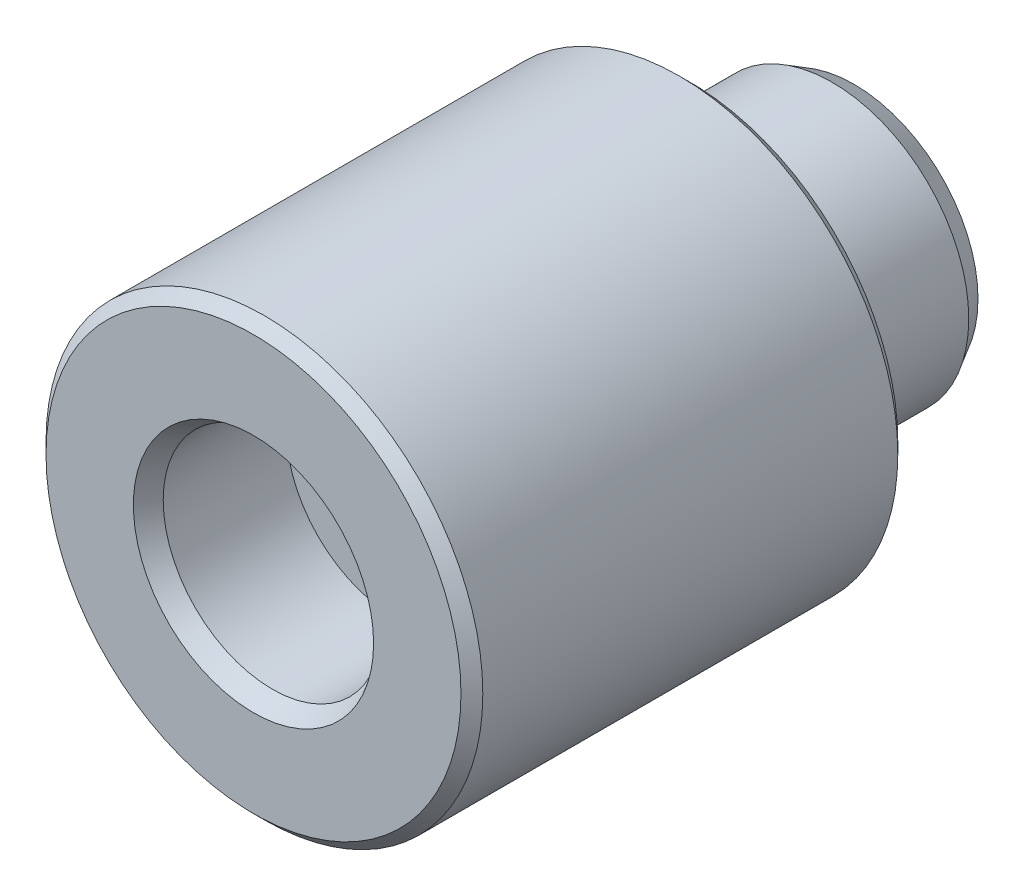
ISO-10303-21;
HEADER;
FILE_DESCRIPTION(('STEP AP214'),'2;1');
FILE_NAME('part.step','',(''),(''),'','','');
FILE_SCHEMA(('AUTOMOTIVE_DESIGN { 1 0 10303 214 1 1 1 1 }'));
ENDSEC;
DATA;
#1=APPLICATION_CONTEXT('core data for automotive mechanical design processes');
#2=APPLICATION_PROTOCOL_DEFINITION('international standard','automotive_design',2000,#1);
#3=PRODUCT_CONTEXT('',#1,'mechanical');
#4=PRODUCT('Part','Part','',(#3));
#5=PRODUCT_RELATED_PRODUCT_CATEGORY('part','',(#4));
#6=PRODUCT_DEFINITION_FORMATION('','',#4);
#7=PRODUCT_DEFINITION_CONTEXT('part definition',#1,'design');
#8=PRODUCT_DEFINITION('design','',#6,#7);
#9=PRODUCT_DEFINITION_SHAPE('','',#8);
#10=(LENGTH_UNIT() NAMED_UNIT(*) SI_UNIT(.MILLI.,.METRE.));
#11=(NAMED_UNIT(*) PLANE_ANGLE_UNIT() SI_UNIT($,.RADIAN.));
#12=(NAMED_UNIT(*) SI_UNIT($,.STERADIAN.) SOLID_ANGLE_UNIT());
#13=UNCERTAINTY_MEASURE_WITH_UNIT(LENGTH_MEASURE(1.E-05),#10,'distance_accuracy_value','');
#14=(GEOMETRIC_REPRESENTATION_CONTEXT(3) GLOBAL_UNCERTAINTY_ASSIGNED_CONTEXT((#13)) GLOBAL_UNIT_ASSIGNED_CONTEXT((#10,
#11,#12)) REPRESENTATION_CONTEXT('',''));
#15=CARTESIAN_POINT('',(0.,0.,0.));
#16=DIRECTION('',(0.,0.,1.));
#17=DIRECTION('',(1.,0.,0.));
#18=AXIS2_PLACEMENT_3D('',#15,#16,#17);
#19=CARTESIAN_POINT('',(0.,0.,-22.5684167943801));
#20=DIRECTION('',(0.,0.,-1.));
#21=DIRECTION('',(-1.,0.,0.));
#22=AXIS2_PLACEMENT_3D('',#19,#20,#21);
#23=CYLINDRICAL_SURFACE('',#22,20.);
#24=CARTESIAN_POINT('',(0.,0.,1.));
#25=DIRECTION('',(0.,0.,1.));
#26=DIRECTION('',(1.,0.,0.));
#27=AXIS2_PLACEMENT_3D('',#24,#25,#26);
#28=CIRCLE('',#27,20.);
#29=CARTESIAN_POINT('',(20.,0.,1.));
#30=VERTEX_POINT('',#29);
#31=EDGE_CURVE('E19',#30,#30,#28,.T.);
#32=ORIENTED_EDGE('',*,*,#31,.T.);
#33=EDGE_LOOP('',(#32));
#34=FACE_BOUND('',#33,.T.);
#35=CARTESIAN_POINT('',(0.,0.,39.));
#36=DIRECTION('',(0.,0.,-1.));
#37=DIRECTION('',(-1.,0.,0.));
#38=AXIS2_PLACEMENT_3D('',#35,#36,#37);
#39=CIRCLE('',#38,20.);
#40=CARTESIAN_POINT('',(-20.,0.,39.));
#41=VERTEX_POINT('',#40);
#42=EDGE_CURVE('E23',#41,#41,#39,.T.);
#43=ORIENTED_EDGE('',*,*,#42,.T.);
#44=EDGE_LOOP('',(#43));
#45=FACE_BOUND('',#44,.T.);
#46=ADVANCED_FACE('F12',(#34,#45),#23,.T.);
#47=CARTESIAN_POINT('',(13.7,0.,0.));
#48=DIRECTION('',(0.,0.,1.));
#49=DIRECTION('',(1.,0.,0.));
#50=AXIS2_PLACEMENT_3D('',#47,#48,#49);
#51=PLANE('',#50);
#52=CARTESIAN_POINT('',(0.,0.,0.));
#53=DIRECTION('',(0.,0.,1.));
#54=DIRECTION('',(1.,0.,0.));
#55=AXIS2_PLACEMENT_3D('',#52,#53,#54);
#56=CIRCLE('',#55,12.5);
#57=CARTESIAN_POINT('',(12.5,0.,0.));
#58=VERTEX_POINT('',#57);
#59=EDGE_CURVE('E56',#58,#58,#56,.T.);
#60=ORIENTED_EDGE('',*,*,#59,.T.);
#61=EDGE_LOOP('',(#60));
#62=FACE_BOUND('',#61,.T.);
#63=CARTESIAN_POINT('',(0.,0.,0.));
#64=DIRECTION('',(0.,0.,1.));
#65=DIRECTION('',(1.,0.,0.));
#66=AXIS2_PLACEMENT_3D('',#63,#64,#65);
#67=CIRCLE('',#66,19.);
#68=CARTESIAN_POINT('',(19.,0.,0.));
#69=VERTEX_POINT('',#68);
#70=EDGE_CURVE('E27',#69,#69,#67,.F.);
#71=ORIENTED_EDGE('',*,*,#70,.T.);
#72=EDGE_LOOP('',(#71));
#73=FACE_BOUND('',#72,.T.);
#74=ADVANCED_FACE('F60',(#62,#73),#51,.F.);
#75=CARTESIAN_POINT('',(0.,0.,-22.5684167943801));
#76=DIRECTION('',(0.,0.,-1.));
#77=DIRECTION('',(-1.,0.,0.));
#78=AXIS2_PLACEMENT_3D('',#75,#76,#77);
#79=CYLINDRICAL_SURFACE('',#78,12.5);
#80=CARTESIAN_POINT('',(0.,0.,-13.));
#81=DIRECTION('',(0.,0.,1.));
#82=DIRECTION('',(1.,0.,0.));
#83=AXIS2_PLACEMENT_3D('',#80,#81,#82);
#84=CIRCLE('',#83,12.5);
#85=CARTESIAN_POINT('',(12.5,0.,-13.));
#86=VERTEX_POINT('',#85);
#87=EDGE_CURVE('E32',#86,#86,#84,.T.);
#88=ORIENTED_EDGE('',*,*,#87,.T.);
#89=EDGE_LOOP('',(#88));
#90=FACE_BOUND('',#89,.T.);
#91=ORIENTED_EDGE('',*,*,#59,.F.);
#92=EDGE_LOOP('',(#91));
#93=FACE_BOUND('',#92,.T.);
#94=ADVANCED_FACE('F63',(#90,#93),#79,.T.);
#95=CARTESIAN_POINT('',(0.,0.,-15.));
#96=DIRECTION('',(0.,0.,1.));
#97=DIRECTION('',(1.,0.,0.));
#98=AXIS2_PLACEMENT_3D('',#95,#96,#97);
#99=PLANE('',#98);
#100=CARTESIAN_POINT('',(0.,0.,-15.));
#101=DIRECTION('',(0.,0.,1.));
#102=DIRECTION('',(1.,0.,0.));
#103=AXIS2_PLACEMENT_3D('',#100,#101,#102);
#104=CIRCLE('',#103,11.3452994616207);
#105=CARTESIAN_POINT('',(11.3452994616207,0.,-15.));
#106=VERTEX_POINT('',#105);
#107=EDGE_CURVE('E35',#106,#106,#104,.F.);
#108=ORIENTED_EDGE('',*,*,#107,.T.);
#109=EDGE_LOOP('',(#108));
#110=FACE_BOUND('',#109,.T.);
#111=CARTESIAN_POINT('',(0.,0.,-15.));
#112=DIRECTION('',(0.,0.,1.));
#113=DIRECTION('',(1.,0.,0.));
#114=AXIS2_PLACEMENT_3D('',#111,#112,#113);
#115=CIRCLE('',#114,8.);
#116=CARTESIAN_POINT('',(8.,0.,-15.));
#117=VERTEX_POINT('',#116);
#118=EDGE_CURVE('E38',#117,#117,#115,.T.);
#119=ORIENTED_EDGE('',*,*,#118,.T.);
#120=EDGE_LOOP('',(#119));
#121=FACE_BOUND('',#120,.T.);
#122=ADVANCED_FACE('F65',(#110,#121),#99,.F.);
#123=CARTESIAN_POINT('',(20.,0.,40.));
#124=DIRECTION('',(0.,0.,-1.));
#125=DIRECTION('',(-1.,0.,0.));
#126=AXIS2_PLACEMENT_3D('',#123,#124,#125);
#127=PLANE('',#126);
#128=CARTESIAN_POINT('',(0.,0.,40.));
#129=DIRECTION('',(0.,0.,-1.));
#130=DIRECTION('',(-1.,0.,0.));
#131=AXIS2_PLACEMENT_3D('',#128,#129,#130);
#132=CIRCLE('',#131,19.);
#133=CARTESIAN_POINT('',(-19.,0.,40.));
#134=VERTEX_POINT('',#133);
#135=EDGE_CURVE('E8',#134,#134,#132,.F.);
#136=ORIENTED_EDGE('',*,*,#135,.T.);
#137=EDGE_LOOP('',(#136));
#138=FACE_BOUND('',#137,.T.);
#139=CARTESIAN_POINT('',(0.,0.,40.));
#140=DIRECTION('',(0.,0.,1.));
#141=DIRECTION('',(1.,0.,0.));
#142=AXIS2_PLACEMENT_3D('',#139,#140,#141);
#143=CIRCLE('',#142,11.);
#144=CARTESIAN_POINT('',(11.,0.,40.));
#145=VERTEX_POINT('',#144);
#146=EDGE_CURVE('E53',#145,#145,#143,.T.);
#147=ORIENTED_EDGE('',*,*,#146,.F.);
#148=EDGE_LOOP('',(#147));
#149=FACE_BOUND('',#148,.T.);
#150=ADVANCED_FACE('F73',(#138,#149),#127,.F.);
#151=CARTESIAN_POINT('',(0.,0.,-13.2679491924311));
#152=DIRECTION('',(0.,0.,-1.));
#153=DIRECTION('',(-1.,0.,0.));
#154=AXIS2_PLACEMENT_3D('',#151,#152,#153);
#155=CONICAL_SURFACE('',#154,7.,0.523598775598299);
#156=ORIENTED_EDGE('',*,*,#118,.F.);
#157=EDGE_LOOP('',(#156));
#158=FACE_BOUND('',#157,.T.);
#159=CARTESIAN_POINT('',(0.,0.,-13.2679491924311));
#160=DIRECTION('',(0.,0.,1.));
#161=DIRECTION('',(1.,0.,0.));
#162=AXIS2_PLACEMENT_3D('',#159,#160,#161);
#163=CIRCLE('',#162,7.);
#164=CARTESIAN_POINT('',(7.,0.,-13.2679491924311));
#165=VERTEX_POINT('',#164);
#166=EDGE_CURVE('E41',#165,#165,#163,.T.);
#167=ORIENTED_EDGE('',*,*,#166,.T.);
#168=EDGE_LOOP('',(#167));
#169=FACE_BOUND('',#168,.T.);
#170=ADVANCED_FACE('F156',(#158,#169),#155,.F.);
#171=CARTESIAN_POINT('',(0.,0.,40.));
#172=DIRECTION('',(0.,0.,1.));
#173=DIRECTION('',(1.,0.,0.));
#174=AXIS2_PLACEMENT_3D('',#171,#172,#173);
#175=CYLINDRICAL_SURFACE('',#174,7.);
#176=ORIENTED_EDGE('',*,*,#166,.F.);
#177=EDGE_LOOP('',(#176));
#178=FACE_BOUND('',#177,.T.);
#179=CARTESIAN_POINT('',(0.,0.,27.));
#180=DIRECTION('',(0.,0.,1.));
#181=DIRECTION('',(1.,0.,0.));
#182=AXIS2_PLACEMENT_3D('',#179,#180,#181);
#183=CIRCLE('',#182,7.);
#184=CARTESIAN_POINT('',(7.,0.,27.));
#185=VERTEX_POINT('',#184);
#186=EDGE_CURVE('E44',#185,#185,#183,.T.);
#187=ORIENTED_EDGE('',*,*,#186,.T.);
#188=EDGE_LOOP('',(#187));
#189=FACE_BOUND('',#188,.T.);
#190=ADVANCED_FACE('F146',(#178,#189),#175,.F.);
#191=CARTESIAN_POINT('',(10.,0.,27.));
#192=DIRECTION('',(0.,0.,-1.));
#193=DIRECTION('',(-1.,0.,0.));
#194=AXIS2_PLACEMENT_3D('',#191,#192,#193);
#195=PLANE('',#194);
#196=ORIENTED_EDGE('',*,*,#186,.F.);
#197=EDGE_LOOP('',(#196));
#198=FACE_BOUND('',#197,.T.);
#199=CARTESIAN_POINT('',(0.,0.,27.));
#200=DIRECTION('',(0.,0.,1.));
#201=DIRECTION('',(1.,0.,0.));
#202=AXIS2_PLACEMENT_3D('',#199,#200,#201);
#203=CIRCLE('',#202,10.);
#204=CARTESIAN_POINT('',(10.,0.,27.));
#205=VERTEX_POINT('',#204);
#206=EDGE_CURVE('E47',#205,#205,#203,.T.);
#207=ORIENTED_EDGE('',*,*,#206,.T.);
#208=EDGE_LOOP('',(#207));
#209=FACE_BOUND('',#208,.T.);
#210=ADVANCED_FACE('F136',(#198,#209),#195,.F.);
#211=CARTESIAN_POINT('',(0.,0.,40.));
#212=DIRECTION('',(0.,0.,1.));
#213=DIRECTION('',(1.,0.,0.));
#214=AXIS2_PLACEMENT_3D('',#211,#212,#213);
#215=CYLINDRICAL_SURFACE('',#214,10.);
#216=ORIENTED_EDGE('',*,*,#206,.F.);
#217=EDGE_LOOP('',(#216));
#218=FACE_BOUND('',#217,.T.);
#219=CARTESIAN_POINT('',(0.,0.,38.2679491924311));
#220=DIRECTION('',(0.,0.,1.));
#221=DIRECTION('',(1.,0.,0.));
#222=AXIS2_PLACEMENT_3D('',#219,#220,#221);
#223=CIRCLE('',#222,10.);
#224=CARTESIAN_POINT('',(10.,0.,38.2679491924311));
#225=VERTEX_POINT('',#224);
#226=EDGE_CURVE('E50',#225,#225,#223,.T.);
#227=ORIENTED_EDGE('',*,*,#226,.T.);
#228=EDGE_LOOP('',(#227));
#229=FACE_BOUND('',#228,.T.);
#230=ADVANCED_FACE('F126',(#218,#229),#215,.F.);
#231=CARTESIAN_POINT('',(0.,0.,40.));
#232=DIRECTION('',(0.,0.,1.));
#233=DIRECTION('',(1.,0.,0.));
#234=AXIS2_PLACEMENT_3D('',#231,#232,#233);
#235=CONICAL_SURFACE('',#234,11.,0.523598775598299);
#236=ORIENTED_EDGE('',*,*,#226,.F.);
#237=EDGE_LOOP('',(#236));
#238=FACE_BOUND('',#237,.T.);
#239=ORIENTED_EDGE('',*,*,#146,.T.);
#240=EDGE_LOOP('',(#239));
#241=FACE_BOUND('',#240,.T.);
#242=ADVANCED_FACE('F86',(#238,#241),#235,.F.);
#243=CARTESIAN_POINT('',(0.,0.,-15.));
#244=DIRECTION('',(0.,0.,1.));
#245=DIRECTION('',(1.,0.,0.));
#246=AXIS2_PLACEMENT_3D('',#243,#244,#245);
#247=CONICAL_SURFACE('',#246,11.3452994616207,0.523598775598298);
#248=ORIENTED_EDGE('',*,*,#87,.F.);
#249=EDGE_LOOP('',(#248));
#250=FACE_BOUND('',#249,.T.);
#251=ORIENTED_EDGE('',*,*,#107,.F.);
#252=EDGE_LOOP('',(#251));
#253=FACE_BOUND('',#252,.T.);
#254=ADVANCED_FACE('F83',(#250,#253),#247,.T.);
#255=CARTESIAN_POINT('',(0.,0.,0.));
#256=DIRECTION('',(0.,0.,1.));
#257=DIRECTION('',(1.,0.,0.));
#258=AXIS2_PLACEMENT_3D('',#255,#256,#257);
#259=CONICAL_SURFACE('',#258,19.,0.785398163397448);
#260=ORIENTED_EDGE('',*,*,#31,.F.);
#261=EDGE_LOOP('',(#260));
#262=FACE_BOUND('',#261,.T.);
#263=ORIENTED_EDGE('',*,*,#70,.F.);
#264=EDGE_LOOP('',(#263));
#265=FACE_BOUND('',#264,.T.);
#266=ADVANCED_FACE('F85',(#262,#265),#259,.T.);
#267=CARTESIAN_POINT('',(0.,0.,39.));
#268=DIRECTION('',(0.,0.,-1.));
#269=DIRECTION('',(-1.,0.,0.));
#270=AXIS2_PLACEMENT_3D('',#267,#268,#269);
#271=CONICAL_SURFACE('',#270,20.,0.785398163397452);
#272=ORIENTED_EDGE('',*,*,#135,.F.);
#273=EDGE_LOOP('',(#272));
#274=FACE_BOUND('',#273,.T.);
#275=ORIENTED_EDGE('',*,*,#42,.F.);
#276=EDGE_LOOP('',(#275));
#277=FACE_BOUND('',#276,.T.);
#278=ADVANCED_FACE('F14',(#274,#277),#271,.T.);
#279=CLOSED_SHELL('',(#46,#74,#94,#122,#150,#170,#190,#210,#230,#242,#254,#266,#278));
#280=MANIFOLD_SOLID_BREP('B1',#279);
#281=ADVANCED_BREP_SHAPE_REPRESENTATION('',(#18,#280),#14);
#282=SHAPE_DEFINITION_REPRESENTATION(#9,#281);
ENDSEC;
END-ISO-10303-21;
